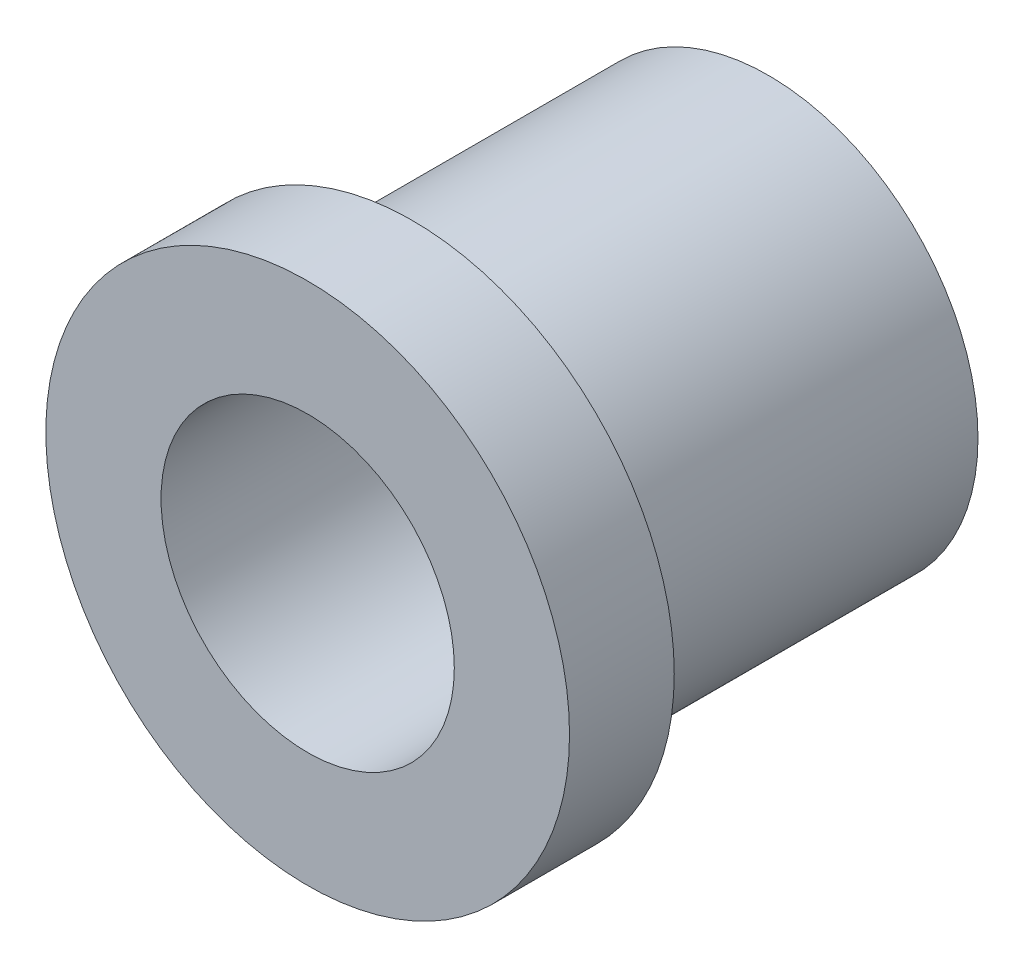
from build123d import *


with BuildPart() as part:
    # Esbo_o1 → Revolu_o1 (revolve)
    with BuildSketch(Plane(origin=(0, 0, 0), x_dir=(1, 0, 0), z_dir=(0, 1, 0))):
        Polygon((7, 0), (12.5, 0), (12.5, 5), (10, 5), (10, 22), (7, 22), align=None)
    revolve(axis=Axis((0, 0, 1.1), (0, 0, -1)))


solid = part.part
